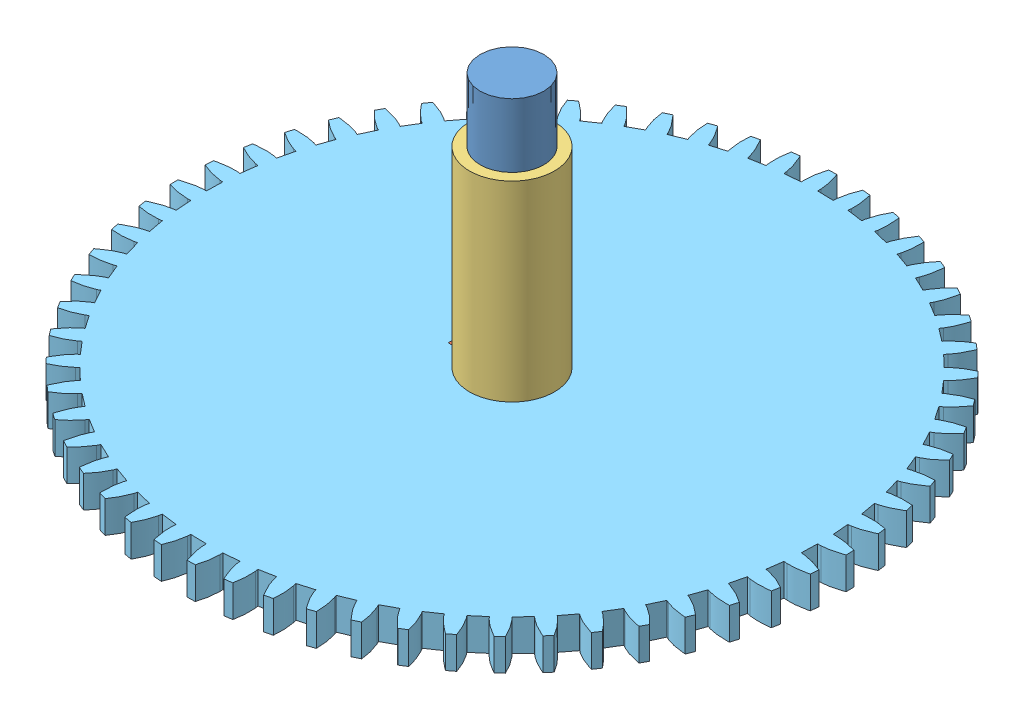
SolidWorks assembly Axle Assembly I.SLDASM, configuration Default (file format 6000). Lengths in mm.
Overall size (31 22.75 31).
5 component instances, 5 part files, 12 mates.
Components (placement in the parent):
- Axle I-1: Axle I.SLDPRT [Default] at (-52.891 -56.0611 58.0718) size (3 20.5 3)
- Key-1: Key.SLDPRT [Default] at (-52.891 -51.5611 58.0718) x (-1 0 0) z (0 0 1) size (2 1.5 1)
- Spacer 9mm-1: Spacer 9mm.SLDPRT [Default] at (-51.391 -42.5611 58.0718) x (-1 0 0) z (0 0 1) size (4 9 4)
- Pointer Back Small-1: Pointer Back Small.SLDPRT [Default] at (-51.391 -59.0611 58.0718) x (-0.981249 0 -0.192745) z (-0.192745 0 0.981249) size (9.01 3.25 4)
- Gear 60T-1: Gear 60T.sldprt [Default] at (-51.391 -53.0611 58.0718) x (0 0 -1) z (1 0 0) size (31 1.5 31)
Mates (geometry in assembly coordinates):
- Coincident1: coincident anti-aligned: plane of Axle I-1 through (-51.891 -56.0611 58.0718) normal (-1 0 0); plane of Key-1 through (-51.891 -53.0611 58.5718) normal (1 0 0)
- Coincident2: coincident anti-aligned: plane of Axle I-1 through (-51.891 -53.0611 57.5718) normal (0 0 1); plane of Key-1 through (-51.891 -53.0611 57.5718) normal (0 0 -1)
- Coincident3: coincident anti-aligned: plane of Axle I-1 through (-51.891 -53.0611 57.5718) normal (0 1 0); plane of Key-1 through (-52.891 -53.0611 58.0718) normal (0 -1 0)
- Concentric2: concentric anti-aligned: cylinder of Axle I-1 through (-51.391 -39.5611 58.0718) axis (0 -1 0) radius 1.5; cylinder of Spacer 9mm-1 through (-51.391 -51.5611 58.0718) axis (0 1 0) radius 1.5
- Parallel2: parallel anti-aligned: line of Key-1 through (-53.891 -51.5611 58.5718) axis (0 0 -1); line of Spacer 9mm-1 through (-51.391 -42.5611 58.0718) axis (0 0 1)
- Concentric3: concentric aligned: cylinder of Axle I-1 through (-51.391 -60.0611 58.0718) axis (0 1 0) radius 1; cylinder of Pointer Back Small-1 through (-51.391 -59.0611 58.0718) axis (0 1 0) radius 1
- Coincident7: coincident anti-aligned: plane of Axle I-1 through (-51.391 -60.0611 58.0718) normal (0 -1 0); plane of Pointer Back Small-1 through (-51.391 -60.0611 58.0718) normal (0 1 0)
- Coincident9: coincident anti-aligned: plane of Key-1 through (-52.891 -51.5611 58.0718) normal (0 1 0); plane of Spacer 9mm-1 through (-51.391 -51.5611 58.0718) normal (0 -1 0)
- Parallel3: parallel anti-aligned: line of Key-1 through (-53.891 -53.0611 57.5718) axis (1 0 0); line of Pointer Back Small-1 through (-52.9737 -60.0611 56.7226) axis (-1 0 0)
- Coincident11: coincident aligned: plane of Key-1 through (-52.891 -51.5611 58.0718) normal (0 1 0); plane of Gear 60T-1 through (-46.0379 -51.5611 78.8353) normal (0 1 0)
- Concentric4: concentric aligned: cylinder of Axle I-1 through (-51.391 -39.5611 58.0718) axis (0 -1 0) radius 1.5; cylinder of Gear 60T-1 through (-51.391 -51.5611 58.0718) axis (0 -1 0) radius 1.5
- Coincident12: coincident anti-aligned: line of Key-1 through (-53.891 -51.5611 58.5718) axis (0 0 -1); line of Gear 60T-1 through (-53.891 -51.5611 57.5718) axis (0 0 1)
